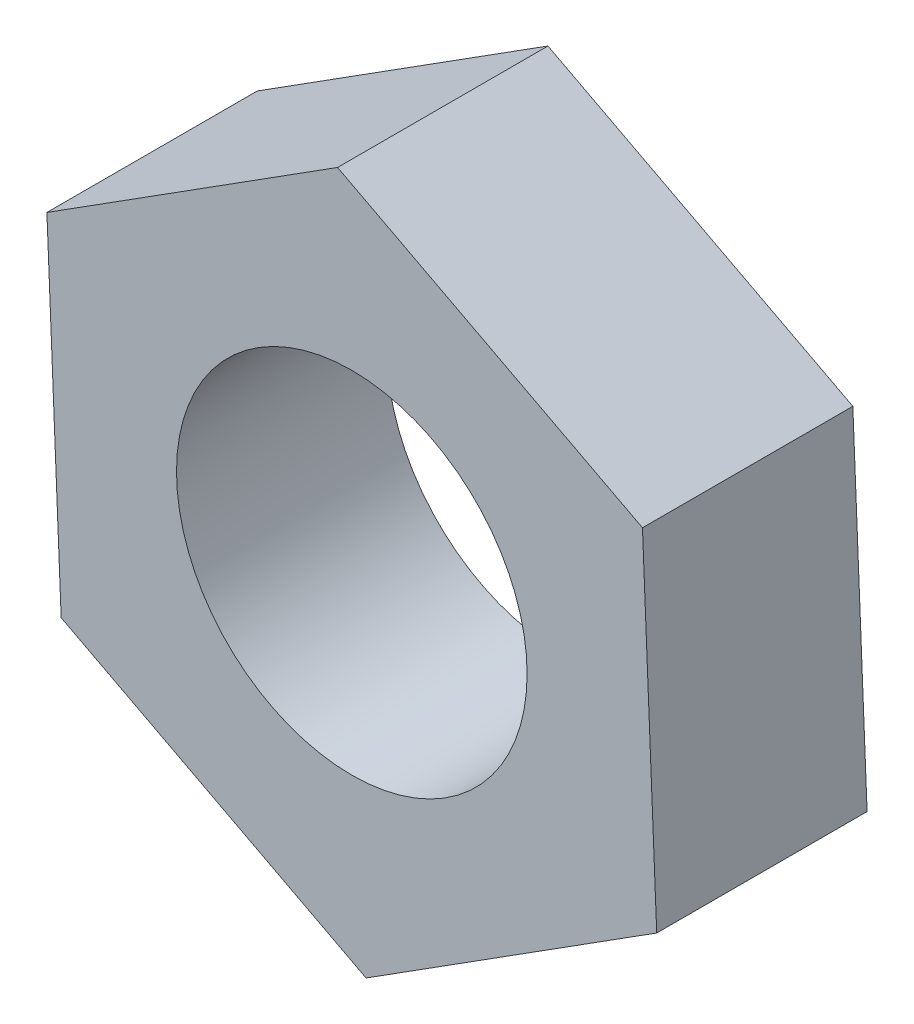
from build123d import *

# Parameters (mm, degrees)
EXTRUDE_1_DEPTH       = 6
M10X1_0_1_D           = 9
M10X1_0_1_DEPTH       = 25
M10X1_0_1_CBORE_D     = 10
M10X1_0_1_CBORE_DEPTH = 20
M10X1_0_1_TIP         = 2.703872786


with BuildPart() as part:
    # Sketch 1 → Extrude 1 (new body)
    with BuildSketch(Plane.XY):
        Polygon((8.695986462, -4.551170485), (8.289422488, 5.255359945), (-0.406563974, 9.80653043), (-8.695986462, 4.551170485), (-8.289422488, -5.255359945), (0.406563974, -9.80653043), align=None)
    extrude(amount=EXTRUDE_1_DEPTH)

    # M10x1.0 _1
    with Locations(Plane.XY.offset(6)):
        with Locations((0, 0)):
            CounterBoreHole(M10X1_0_1_D / 2, M10X1_0_1_CBORE_D / 2, M10X1_0_1_CBORE_DEPTH, depth=M10X1_0_1_DEPTH)
            with Locations((0, 0, -(M10X1_0_1_DEPTH + M10X1_0_1_TIP / 2))):  # 118° drill point
                Cone(0, M10X1_0_1_D / 2, M10X1_0_1_TIP, mode=Mode.SUBTRACT)


solid = part.part
